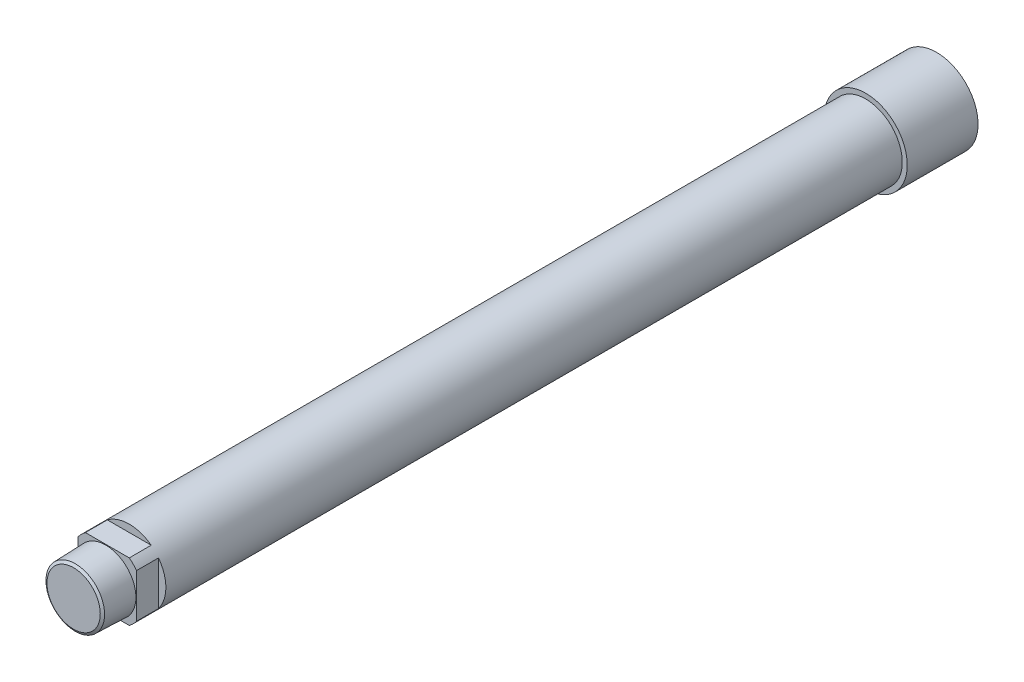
from build123d import *

# Parameters (mm, degrees)
SKETCH1_R                     = 15.875
SKETCH1_R_2                   = 9.525
BASE_EXTRUDE_DEPTH            = 343.789
SKETCH11_R                    = 25.4
SKETCH11_W                    = 25.4
SKETCH11_H                    = 25.4
CUT_EXTRUDE5_DEPTH            = 9.525
SKETCH12_R                    = 3.2766
CUT_EXTRUDE6_DEPTH            = 5.715
CIRPATTERN2_COUNT             = 4
F_15_16_16_TAPPED_HOLE1_D     = 22.225
F_15_16_16_TAPPED_HOLE1_DEPTH = 20.6375
F_15_16_16_TAPPED_HOLE1_TIP   = 6.677063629
SKETCH16_R                    = 18.034
WEB_EXTRUDE1_DEPTH            = 30.734
SKETCH17_R                    = 7.9375
WEB_CUT_EXTRUDE1_DEPTH        = 230.759


with BuildPart() as part:
    # Sketch1 → Base-Extrude (new body)
    with BuildSketch(Plane.XY):
        with Locations(Location((0, 0, 0), (0, 0, 180))):
            Circle(SKETCH1_R)
        with Locations(Location((0, 0, 0), (0, 0, 180))):
            Circle(SKETCH1_R_2, mode=Mode.SUBTRACT)
    extrude(amount=BASE_EXTRUDE_DEPTH)

    # Sketch9 → Cut-Revolve1 (revolve, cut)
    with BuildSketch(Plane(origin=(0, 0, 0), x_dir=(0, 0, -1), z_dir=(1, 0, 0)), mode=Mode.PRIVATE) as cut_revolve1_sk:
        Polygon((-343.789, 11.5697), (-342.8746, 13.04591668), (-341.9602, 11.62653336), (-341.0458, 13.10275004), (-340.1314, 11.68336672), (-339.217, 13.159583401), (-338.3026, 11.740200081), (-337.3882, 13.216416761), (-336.4738, 11.797033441), (-335.5594, 13.273250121), (-334.645, 11.853866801), (-333.7306, 13.330083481), (-332.8162, 11.910700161), (-331.9018, 13.386916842), (-330.9874, 11.967533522), (-330.073, 13.443750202), (-329.1586, 12.024366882), (-329.1586, 15.875), (-343.789, 15.875), align=None)
    revolve(cut_revolve1_sk.sketch.rotate(Axis((0, 0, 343.789), (0, 0, -1)), 90), axis=Axis((0, 0, 343.789), (0, 0, -1)), mode=Mode.SUBTRACT)

    # Sketch10 → Cut-Revolve2 (revolve, cut)
    with BuildSketch(Plane(origin=(0, 0, 0), x_dir=(0, 0, -1), z_dir=(1, 0, 0)), mode=Mode.PRIVATE) as cut_revolve2_sk:
        Polygon((-343.789, 12.7), (-343.789, 15.875), (-329.1586, 15.875), (-329.1586, 13.154666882), align=None)
    revolve(cut_revolve2_sk.sketch.rotate(Axis((0, 0, 343.789), (0, 0, -1)), 90), axis=Axis((0, 0, 343.789), (0, 0, -1)), mode=Mode.SUBTRACT)

    # Sketch11 → Cut-Extrude5 (cut)
    with BuildSketch(Plane.XY.offset(329.1586)):
        Circle(SKETCH11_R)
        Rectangle(SKETCH11_W, SKETCH11_H, mode=Mode.SUBTRACT)
    extrude(amount=-CUT_EXTRUDE5_DEPTH, mode=Mode.SUBTRACT)

    # Sketch12 → Cut-Extrude6 (cut)
    with BuildSketch(Plane(origin=(15.875, 0, 0), x_dir=(0, 0, -1), z_dir=(1, 0, 0))):
        with Locations((-28.575, 0)):
            Circle(SKETCH12_R)
    cut_extrude6 = extrude(amount=-CUT_EXTRUDE6_DEPTH, mode=Mode.SUBTRACT)

    # CirPattern2: Cut-Extrude6 ×4 about axis
    cirpattern2_axis = Axis((0, 0, 0), (0, 0, 1))
    for i in range(1, CIRPATTERN2_COUNT):
        add(cut_extrude6.rotate(cirpattern2_axis, i * 360 / CIRPATTERN2_COUNT), mode=Mode.SUBTRACT)

    # 15_16-16 Tapped Hole1
    with Locations(Plane(origin=(0, 0, 0), x_dir=(-1, 0, 0), z_dir=(0, 0, -1))):
        with Locations((0, 0)):
            Hole(F_15_16_16_TAPPED_HOLE1_D / 2, depth=F_15_16_16_TAPPED_HOLE1_DEPTH)
            with Locations((0, 0, -(F_15_16_16_TAPPED_HOLE1_DEPTH + F_15_16_16_TAPPED_HOLE1_TIP / 2))):  # 118° drill point
                Cone(0, F_15_16_16_TAPPED_HOLE1_D / 2, F_15_16_16_TAPPED_HOLE1_TIP, mode=Mode.SUBTRACT)

    # Sketch15 → WEB Revolve1 (revolve)
    with BuildSketch(Plane(origin=(0, 0, 0), x_dir=(0, 0, -1), z_dir=(1, 0, 0)), mode=Mode.PRIVATE) as web_revolve1_sk:
        Polygon((-343.789, 0), (-343.789, 11.5697), (-343.075126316, 12.722184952), (-329.872473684, 13.13248193), (-329.1586, 12.024366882), (-329.1586, 12.7), (-319.6336, 12.7), (-319.6336, 15.875), (0, 15.875), (0, 0), align=None)
    revolve(web_revolve1_sk.sketch.rotate(Axis((0, 0, 158.265865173), (0, 0, -1)), 233.130102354), axis=Axis((0, 0, 158.265865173), (0, 0, -1)))

    # Sketch16 → WEB Extrude1 (add)
    with BuildSketch(Plane(origin=(0, 0, 0), x_dir=(-1, 0, 0), z_dir=(0, 0, -1))):
        Circle(SKETCH16_R)
    extrude(amount=WEB_EXTRUDE1_DEPTH)

    # Sketch17 → WEB CUT Extrude1 (cut)
    with BuildSketch(Plane(origin=(0, 0, -30.734), x_dir=(-1, 0, 0), z_dir=(0, 0, -1))):
        Circle(SKETCH17_R)
    extrude(amount=-WEB_CUT_EXTRUDE1_DEPTH, mode=Mode.SUBTRACT)


solid = part.part
